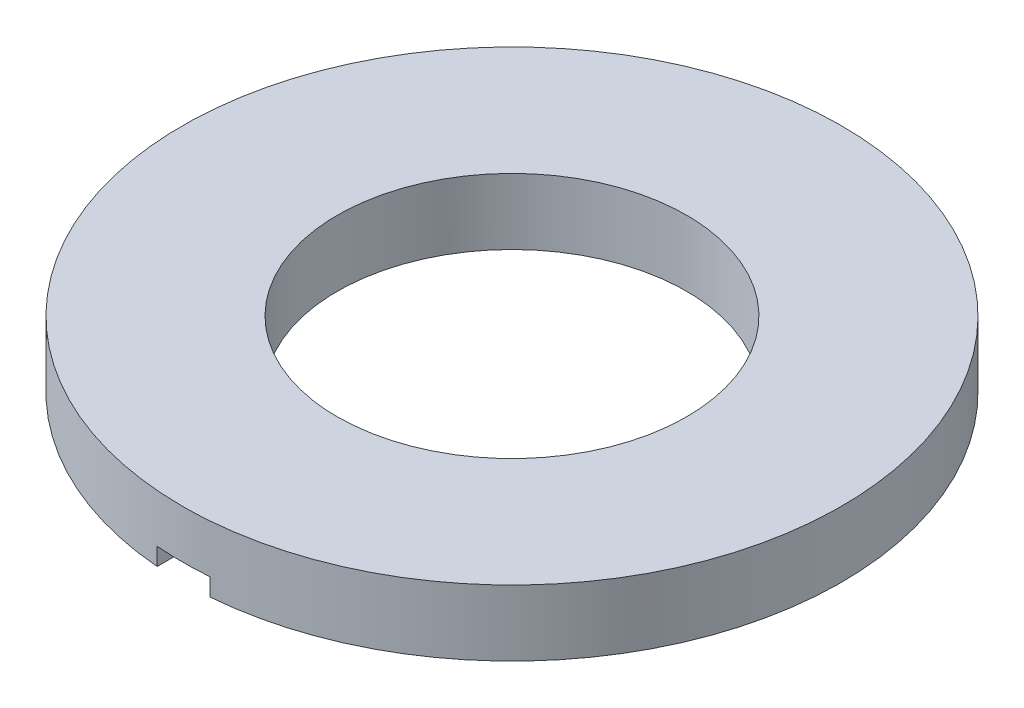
ISO-10303-21;
HEADER;
FILE_DESCRIPTION(('STEP AP214'),'2;1');
FILE_NAME('part.step','',(''),(''),'','','');
FILE_SCHEMA(('AUTOMOTIVE_DESIGN { 1 0 10303 214 1 1 1 1 }'));
ENDSEC;
DATA;
#1=APPLICATION_CONTEXT('core data for automotive mechanical design processes');
#2=APPLICATION_PROTOCOL_DEFINITION('international standard','automotive_design',2000,#1);
#3=PRODUCT_CONTEXT('',#1,'mechanical');
#4=PRODUCT('Part','Part','',(#3));
#5=PRODUCT_RELATED_PRODUCT_CATEGORY('part','',(#4));
#6=PRODUCT_DEFINITION_FORMATION('','',#4);
#7=PRODUCT_DEFINITION_CONTEXT('part definition',#1,'design');
#8=PRODUCT_DEFINITION('design','',#6,#7);
#9=PRODUCT_DEFINITION_SHAPE('','',#8);
#10=(LENGTH_UNIT() NAMED_UNIT(*) SI_UNIT(.MILLI.,.METRE.));
#11=(NAMED_UNIT(*) PLANE_ANGLE_UNIT() SI_UNIT($,.RADIAN.));
#12=(NAMED_UNIT(*) SI_UNIT($,.STERADIAN.) SOLID_ANGLE_UNIT());
#13=UNCERTAINTY_MEASURE_WITH_UNIT(LENGTH_MEASURE(1.E-05),#10,'distance_accuracy_value','');
#14=(GEOMETRIC_REPRESENTATION_CONTEXT(3) GLOBAL_UNCERTAINTY_ASSIGNED_CONTEXT((#13)) GLOBAL_UNIT_ASSIGNED_CONTEXT((#10,
#11,#12)) REPRESENTATION_CONTEXT('',''));
#15=CARTESIAN_POINT('',(0.,0.,0.));
#16=DIRECTION('',(0.,0.,1.));
#17=DIRECTION('',(1.,0.,0.));
#18=AXIS2_PLACEMENT_3D('',#15,#16,#17);
#19=CARTESIAN_POINT('',(0.,1.,0.));
#20=DIRECTION('',(0.,1.,0.));
#21=DIRECTION('',(0.,0.,1.));
#22=AXIS2_PLACEMENT_3D('',#19,#20,#21);
#23=PLANE('',#22);
#24=CARTESIAN_POINT('',(0.,1.,0.));
#25=DIRECTION('',(0.,1.,0.));
#26=DIRECTION('',(0.,0.,1.));
#27=AXIS2_PLACEMENT_3D('',#24,#25,#26);
#28=CIRCLE('',#27,5.);
#29=CARTESIAN_POINT('',(0.,1.,5.));
#30=VERTEX_POINT('',#29);
#31=EDGE_CURVE('E113',#30,#30,#28,.T.);
#32=ORIENTED_EDGE('',*,*,#31,.T.);
#33=EDGE_LOOP('',(#32));
#34=FACE_BOUND('',#33,.T.);
#35=CARTESIAN_POINT('',(0.,1.,0.));
#36=DIRECTION('',(0.,1.,0.));
#37=DIRECTION('',(0.,0.,1.));
#38=AXIS2_PLACEMENT_3D('',#35,#36,#37);
#39=CIRCLE('',#38,2.65);
#40=CARTESIAN_POINT('',(0.,1.,2.65));
#41=VERTEX_POINT('',#40);
#42=EDGE_CURVE('E102',#41,#41,#39,.T.);
#43=ORIENTED_EDGE('',*,*,#42,.F.);
#44=EDGE_LOOP('',(#43));
#45=FACE_BOUND('',#44,.T.);
#46=ADVANCED_FACE('F39',(#34,#45),#23,.T.);
#47=CARTESIAN_POINT('',(0.,0.,0.));
#48=DIRECTION('',(0.,1.,0.));
#49=DIRECTION('',(0.,0.,1.));
#50=AXIS2_PLACEMENT_3D('',#47,#48,#49);
#51=PLANE('',#50);
#52=CARTESIAN_POINT('',(0.,0.,0.));
#53=DIRECTION('',(0.,1.,0.));
#54=DIRECTION('',(0.,0.,1.));
#55=AXIS2_PLACEMENT_3D('',#52,#53,#54);
#56=CIRCLE('',#55,5.);
#57=CARTESIAN_POINT('',(0.4,0.,4.98397431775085));
#58=VERTEX_POINT('',#57);
#59=CARTESIAN_POINT('',(-0.4,0.,4.98397431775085));
#60=VERTEX_POINT('',#59);
#61=EDGE_CURVE('E94',#58,#60,#56,.T.);
#62=ORIENTED_EDGE('',*,*,#61,.F.);
#63=DIRECTION('',(0.,0.,1.));
#64=VECTOR('',#63,1.);
#65=CARTESIAN_POINT('',(0.4,0.,0.3));
#66=LINE('',#65,#64);
#67=CARTESIAN_POINT('',(0.4,0.,2.61963737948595));
#68=VERTEX_POINT('',#67);
#69=EDGE_CURVE('E81',#68,#58,#66,.T.);
#70=ORIENTED_EDGE('',*,*,#69,.F.);
#71=CARTESIAN_POINT('',(0.,0.,0.));
#72=DIRECTION('',(0.,1.,0.));
#73=DIRECTION('',(0.,0.,1.));
#74=AXIS2_PLACEMENT_3D('',#71,#72,#73);
#75=CIRCLE('',#74,2.65);
#76=CARTESIAN_POINT('',(-0.4,0.,2.61963737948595));
#77=VERTEX_POINT('',#76);
#78=EDGE_CURVE('E92',#68,#77,#75,.T.);
#79=ORIENTED_EDGE('',*,*,#78,.T.);
#80=DIRECTION('',(0.,0.,-1.));
#81=VECTOR('',#80,1.);
#82=CARTESIAN_POINT('',(-0.4,0.,0.3));
#83=LINE('',#82,#81);
#84=EDGE_CURVE('E96',#60,#77,#83,.T.);
#85=ORIENTED_EDGE('',*,*,#84,.F.);
#86=EDGE_LOOP('',(#62,#70,#79,#85));
#87=FACE_BOUND('',#86,.T.);
#88=ADVANCED_FACE('F90',(#87),#51,.F.);
#89=CARTESIAN_POINT('',(0.,1.,0.));
#90=DIRECTION('',(0.,-1.,0.));
#91=DIRECTION('',(0.,0.,-1.));
#92=AXIS2_PLACEMENT_3D('',#89,#90,#91);
#93=CYLINDRICAL_SURFACE('',#92,5.);
#94=ORIENTED_EDGE('',*,*,#31,.F.);
#95=EDGE_LOOP('',(#94));
#96=FACE_BOUND('',#95,.T.);
#97=CARTESIAN_POINT('',(0.,0.266666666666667,0.));
#98=DIRECTION('',(0.,1.,0.));
#99=DIRECTION('',(0.,0.,1.));
#100=AXIS2_PLACEMENT_3D('',#97,#98,#99);
#101=CIRCLE('',#100,5.);
#102=CARTESIAN_POINT('',(-0.4,0.266666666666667,4.98397431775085));
#103=VERTEX_POINT('',#102);
#104=CARTESIAN_POINT('',(0.4,0.266666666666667,4.98397431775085));
#105=VERTEX_POINT('',#104);
#106=EDGE_CURVE('E60',#103,#105,#101,.T.);
#107=ORIENTED_EDGE('',*,*,#106,.T.);
#108=DIRECTION('',(0.,-1.,0.));
#109=VECTOR('',#108,1.);
#110=CARTESIAN_POINT('',(0.4,1.,4.98397431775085));
#111=LINE('',#110,#109);
#112=EDGE_CURVE('E103',#105,#58,#111,.T.);
#113=ORIENTED_EDGE('',*,*,#112,.T.);
#114=ORIENTED_EDGE('',*,*,#61,.T.);
#115=DIRECTION('',(0.,-1.,0.));
#116=VECTOR('',#115,1.);
#117=CARTESIAN_POINT('',(-0.4,1.,4.98397431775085));
#118=LINE('',#117,#116);
#119=EDGE_CURVE('E110',#60,#103,#118,.F.);
#120=ORIENTED_EDGE('',*,*,#119,.T.);
#121=EDGE_LOOP('',(#107,#113,#114,#120));
#122=FACE_BOUND('',#121,.T.);
#123=ADVANCED_FACE('F41',(#96,#122),#93,.T.);
#124=CARTESIAN_POINT('',(0.,1.,0.));
#125=DIRECTION('',(0.,-1.,0.));
#126=DIRECTION('',(0.,0.,-1.));
#127=AXIS2_PLACEMENT_3D('',#124,#125,#126);
#128=CYLINDRICAL_SURFACE('',#127,2.65);
#129=DIRECTION('',(0.,-1.,0.));
#130=VECTOR('',#129,1.);
#131=CARTESIAN_POINT('',(0.4,1.,2.61963737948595));
#132=LINE('',#131,#130);
#133=CARTESIAN_POINT('',(0.4,0.266666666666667,2.61963737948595));
#134=VERTEX_POINT('',#133);
#135=EDGE_CURVE('E11',#134,#68,#132,.T.);
#136=ORIENTED_EDGE('',*,*,#135,.F.);
#137=CARTESIAN_POINT('',(0.,0.266666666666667,0.));
#138=DIRECTION('',(0.,1.,0.));
#139=DIRECTION('',(0.,0.,1.));
#140=AXIS2_PLACEMENT_3D('',#137,#138,#139);
#141=CIRCLE('',#140,2.65);
#142=CARTESIAN_POINT('',(-0.4,0.266666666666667,2.61963737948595));
#143=VERTEX_POINT('',#142);
#144=EDGE_CURVE('E117',#143,#134,#141,.T.);
#145=ORIENTED_EDGE('',*,*,#144,.F.);
#146=DIRECTION('',(0.,-1.,0.));
#147=VECTOR('',#146,1.);
#148=CARTESIAN_POINT('',(-0.4,1.,2.61963737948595));
#149=LINE('',#148,#147);
#150=EDGE_CURVE('E48',#77,#143,#149,.F.);
#151=ORIENTED_EDGE('',*,*,#150,.F.);
#152=ORIENTED_EDGE('',*,*,#78,.F.);
#153=EDGE_LOOP('',(#136,#145,#151,#152));
#154=FACE_BOUND('',#153,.T.);
#155=ORIENTED_EDGE('',*,*,#42,.T.);
#156=EDGE_LOOP('',(#155));
#157=FACE_BOUND('',#156,.T.);
#158=ADVANCED_FACE('F99',(#154,#157),#128,.F.);
#159=CARTESIAN_POINT('',(0.4,0.266666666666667,0.3));
#160=DIRECTION('',(1.,0.,0.));
#161=DIRECTION('',(0.,0.,-1.));
#162=AXIS2_PLACEMENT_3D('',#159,#160,#161);
#163=PLANE('',#162);
#164=DIRECTION('',(0.,0.,1.));
#165=VECTOR('',#164,1.);
#166=CARTESIAN_POINT('',(0.4,0.266666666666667,0.3));
#167=LINE('',#166,#165);
#168=EDGE_CURVE('E83',#134,#105,#167,.T.);
#169=ORIENTED_EDGE('',*,*,#168,.F.);
#170=ORIENTED_EDGE('',*,*,#135,.T.);
#171=ORIENTED_EDGE('',*,*,#69,.T.);
#172=ORIENTED_EDGE('',*,*,#112,.F.);
#173=EDGE_LOOP('',(#169,#170,#171,#172));
#174=FACE_BOUND('',#173,.T.);
#175=ADVANCED_FACE('F79',(#174),#163,.F.);
#176=CARTESIAN_POINT('',(-0.4,0.266666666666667,0.3));
#177=DIRECTION('',(-1.,0.,0.));
#178=DIRECTION('',(0.,0.,1.));
#179=AXIS2_PLACEMENT_3D('',#176,#177,#178);
#180=PLANE('',#179);
#181=ORIENTED_EDGE('',*,*,#84,.T.);
#182=ORIENTED_EDGE('',*,*,#150,.T.);
#183=DIRECTION('',(0.,0.,-1.));
#184=VECTOR('',#183,1.);
#185=CARTESIAN_POINT('',(-0.4,0.266666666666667,0.3));
#186=LINE('',#185,#184);
#187=EDGE_CURVE('E55',#103,#143,#186,.T.);
#188=ORIENTED_EDGE('',*,*,#187,.F.);
#189=ORIENTED_EDGE('',*,*,#119,.F.);
#190=EDGE_LOOP('',(#181,#182,#188,#189));
#191=FACE_BOUND('',#190,.T.);
#192=ADVANCED_FACE('F123',(#191),#180,.F.);
#193=CARTESIAN_POINT('',(0.,0.266666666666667,0.));
#194=DIRECTION('',(0.,1.,0.));
#195=DIRECTION('',(0.,0.,1.));
#196=AXIS2_PLACEMENT_3D('',#193,#194,#195);
#197=PLANE('',#196);
#198=ORIENTED_EDGE('',*,*,#106,.F.);
#199=ORIENTED_EDGE('',*,*,#187,.T.);
#200=ORIENTED_EDGE('',*,*,#144,.T.);
#201=ORIENTED_EDGE('',*,*,#168,.T.);
#202=EDGE_LOOP('',(#198,#199,#200,#201));
#203=FACE_BOUND('',#202,.T.);
#204=ADVANCED_FACE('F125',(#203),#197,.F.);
#205=CLOSED_SHELL('',(#46,#88,#123,#158,#175,#192,#204));
#206=MANIFOLD_SOLID_BREP('B2',#205);
#207=ADVANCED_BREP_SHAPE_REPRESENTATION('',(#18,#206),#14);
#208=SHAPE_DEFINITION_REPRESENTATION(#9,#207);
ENDSEC;
END-ISO-10303-21;
